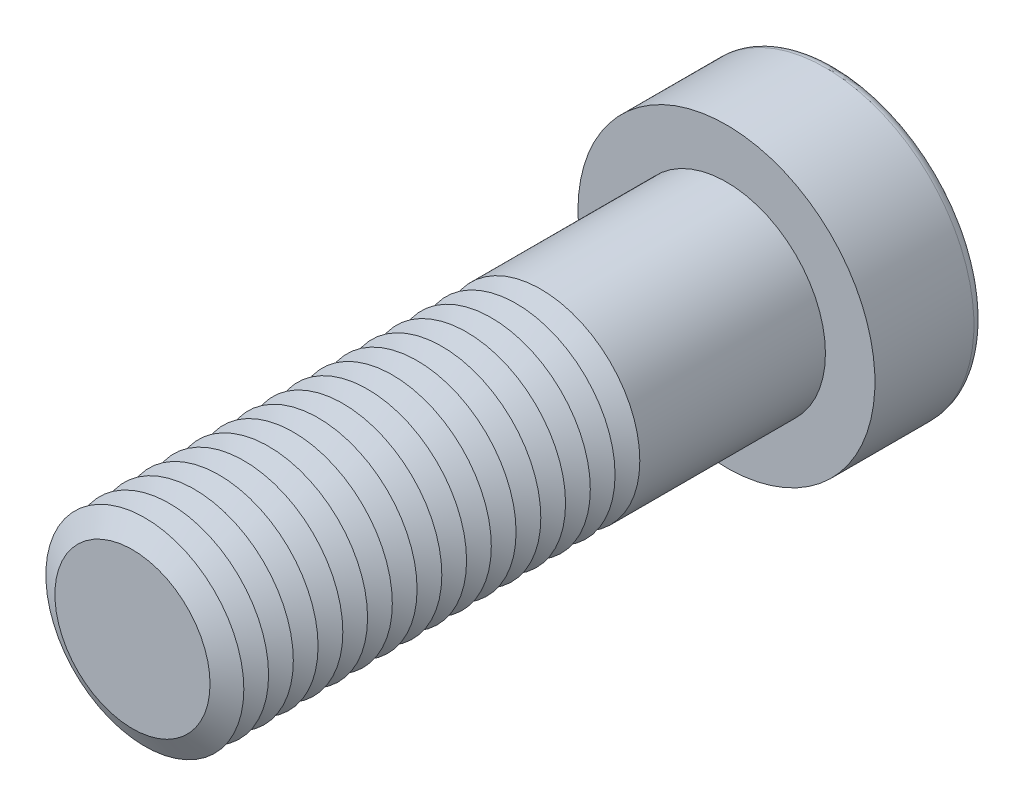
ISO-10303-21;
HEADER;
FILE_DESCRIPTION(('STEP AP214'),'2;1');
FILE_NAME('part.step','',(''),(''),'','','');
FILE_SCHEMA(('AUTOMOTIVE_DESIGN { 1 0 10303 214 1 1 1 1 }'));
ENDSEC;
DATA;
#1=APPLICATION_CONTEXT('core data for automotive mechanical design processes');
#2=APPLICATION_PROTOCOL_DEFINITION('international standard','automotive_design',2000,#1);
#3=PRODUCT_CONTEXT('',#1,'mechanical');
#4=PRODUCT('Part','Part','',(#3));
#5=PRODUCT_RELATED_PRODUCT_CATEGORY('part','',(#4));
#6=PRODUCT_DEFINITION_FORMATION('','',#4);
#7=PRODUCT_DEFINITION_CONTEXT('part definition',#1,'design');
#8=PRODUCT_DEFINITION('design','',#6,#7);
#9=PRODUCT_DEFINITION_SHAPE('','',#8);
#10=(LENGTH_UNIT() NAMED_UNIT(*) SI_UNIT(.MILLI.,.METRE.));
#11=(NAMED_UNIT(*) PLANE_ANGLE_UNIT() SI_UNIT($,.RADIAN.));
#12=(NAMED_UNIT(*) SI_UNIT($,.STERADIAN.) SOLID_ANGLE_UNIT());
#13=UNCERTAINTY_MEASURE_WITH_UNIT(LENGTH_MEASURE(1.E-05),#10,'distance_accuracy_value','');
#14=(GEOMETRIC_REPRESENTATION_CONTEXT(3) GLOBAL_UNCERTAINTY_ASSIGNED_CONTEXT((#13)) GLOBAL_UNIT_ASSIGNED_CONTEXT((#10,
#11,#12)) REPRESENTATION_CONTEXT('',''));
#15=CARTESIAN_POINT('',(0.,0.,0.));
#16=DIRECTION('',(0.,0.,1.));
#17=DIRECTION('',(1.,0.,0.));
#18=AXIS2_PLACEMENT_3D('',#15,#16,#17);
#19=CARTESIAN_POINT('',(0.,0.,51.25));
#20=DIRECTION('',(0.,0.,1.));
#21=DIRECTION('',(1.,0.,0.));
#22=AXIS2_PLACEMENT_3D('',#19,#20,#21);
#23=CONICAL_SURFACE('',#22,10.,1.0471975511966);
#24=CARTESIAN_POINT('',(0.,0.,50.));
#25=DIRECTION('',(0.,0.,1.));
#26=DIRECTION('',(1.,0.,0.));
#27=AXIS2_PLACEMENT_3D('',#24,#25,#26);
#28=CIRCLE('',#27,7.8349364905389);
#29=CARTESIAN_POINT('',(7.8349364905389,0.,50.));
#30=VERTEX_POINT('',#29);
#31=EDGE_CURVE('E312',#30,#30,#28,.T.);
#32=ORIENTED_EDGE('',*,*,#31,.T.);
#33=EDGE_LOOP('',(#32));
#34=FACE_BOUND('',#33,.T.);
#35=CARTESIAN_POINT('',(0.,0.,51.25));
#36=DIRECTION('',(0.,0.,1.));
#37=DIRECTION('',(1.,0.,0.));
#38=AXIS2_PLACEMENT_3D('',#35,#36,#37);
#39=CIRCLE('',#38,10.);
#40=CARTESIAN_POINT('',(10.,0.,51.25));
#41=VERTEX_POINT('',#40);
#42=EDGE_CURVE('E315',#41,#41,#39,.T.);
#43=ORIENTED_EDGE('',*,*,#42,.F.);
#44=EDGE_LOOP('',(#43));
#45=FACE_BOUND('',#44,.T.);
#46=ADVANCED_FACE('F39',(#34,#45),#23,.T.);
#47=CARTESIAN_POINT('',(0.,0.,50.));
#48=DIRECTION('',(0.,0.,-1.));
#49=DIRECTION('',(-1.,0.,0.));
#50=AXIS2_PLACEMENT_3D('',#47,#48,#49);
#51=CONICAL_SURFACE('',#50,7.8349364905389,1.0471975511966);
#52=CARTESIAN_POINT('',(0.,0.,48.75));
#53=DIRECTION('',(0.,0.,1.));
#54=DIRECTION('',(1.,0.,0.));
#55=AXIS2_PLACEMENT_3D('',#52,#53,#54);
#56=CIRCLE('',#55,10.);
#57=CARTESIAN_POINT('',(10.,0.,48.75));
#58=VERTEX_POINT('',#57);
#59=EDGE_CURVE('E323',#58,#58,#56,.T.);
#60=ORIENTED_EDGE('',*,*,#59,.T.);
#61=EDGE_LOOP('',(#60));
#62=FACE_BOUND('',#61,.T.);
#63=ORIENTED_EDGE('',*,*,#31,.F.);
#64=EDGE_LOOP('',(#63));
#65=FACE_BOUND('',#64,.T.);
#66=ADVANCED_FACE('F244',(#62,#65),#51,.T.);
#67=CARTESIAN_POINT('',(0.,0.,60.));
#68=DIRECTION('',(0.,0.,1.));
#69=DIRECTION('',(1.,0.,0.));
#70=AXIS2_PLACEMENT_3D('',#67,#68,#69);
#71=PLANE('',#70);
#72=CARTESIAN_POINT('',(0.,0.,60.));
#73=DIRECTION('',(0.,0.,1.));
#74=DIRECTION('',(1.,0.,0.));
#75=AXIS2_PLACEMENT_3D('',#72,#73,#74);
#76=CIRCLE('',#75,7.8349364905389);
#77=CARTESIAN_POINT('',(7.8349364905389,0.,60.));
#78=VERTEX_POINT('',#77);
#79=EDGE_CURVE('E173',#78,#78,#76,.T.);
#80=ORIENTED_EDGE('',*,*,#79,.T.);
#81=EDGE_LOOP('',(#80));
#82=FACE_BOUND('',#81,.T.);
#83=ADVANCED_FACE('F250',(#82),#71,.T.);
#84=CARTESIAN_POINT('',(0.,0.,60.));
#85=DIRECTION('',(0.,0.,-1.));
#86=DIRECTION('',(-1.,0.,0.));
#87=AXIS2_PLACEMENT_3D('',#84,#85,#86);
#88=CONICAL_SURFACE('',#87,7.8349364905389,1.0471975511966);
#89=CARTESIAN_POINT('',(0.,0.,58.75));
#90=DIRECTION('',(0.,0.,1.));
#91=DIRECTION('',(1.,0.,0.));
#92=AXIS2_PLACEMENT_3D('',#89,#90,#91);
#93=CIRCLE('',#92,10.);
#94=CARTESIAN_POINT('',(10.,0.,58.75));
#95=VERTEX_POINT('',#94);
#96=EDGE_CURVE('E290',#95,#95,#93,.T.);
#97=ORIENTED_EDGE('',*,*,#96,.T.);
#98=EDGE_LOOP('',(#97));
#99=FACE_BOUND('',#98,.T.);
#100=ORIENTED_EDGE('',*,*,#79,.F.);
#101=EDGE_LOOP('',(#100));
#102=FACE_BOUND('',#101,.T.);
#103=ADVANCED_FACE('F198',(#99,#102),#88,.T.);
#104=CARTESIAN_POINT('',(0.,0.,58.75));
#105=DIRECTION('',(0.,0.,1.));
#106=DIRECTION('',(1.,0.,0.));
#107=AXIS2_PLACEMENT_3D('',#104,#105,#106);
#108=CONICAL_SURFACE('',#107,10.,1.0471975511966);
#109=CARTESIAN_POINT('',(0.,0.,57.5));
#110=DIRECTION('',(0.,0.,1.));
#111=DIRECTION('',(1.,0.,0.));
#112=AXIS2_PLACEMENT_3D('',#109,#110,#111);
#113=CIRCLE('',#112,7.8349364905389);
#114=CARTESIAN_POINT('',(7.8349364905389,0.,57.5));
#115=VERTEX_POINT('',#114);
#116=EDGE_CURVE('E287',#115,#115,#113,.T.);
#117=ORIENTED_EDGE('',*,*,#116,.T.);
#118=EDGE_LOOP('',(#117));
#119=FACE_BOUND('',#118,.T.);
#120=ORIENTED_EDGE('',*,*,#96,.F.);
#121=EDGE_LOOP('',(#120));
#122=FACE_BOUND('',#121,.T.);
#123=ADVANCED_FACE('F276',(#119,#122),#108,.T.);
#124=CARTESIAN_POINT('',(0.,0.,57.5));
#125=DIRECTION('',(0.,0.,-1.));
#126=DIRECTION('',(-1.,0.,0.));
#127=AXIS2_PLACEMENT_3D('',#124,#125,#126);
#128=CONICAL_SURFACE('',#127,7.8349364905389,1.0471975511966);
#129=CARTESIAN_POINT('',(0.,0.,56.25));
#130=DIRECTION('',(0.,0.,1.));
#131=DIRECTION('',(1.,0.,0.));
#132=AXIS2_PLACEMENT_3D('',#129,#130,#131);
#133=CIRCLE('',#132,10.);
#134=CARTESIAN_POINT('',(10.,0.,56.25));
#135=VERTEX_POINT('',#134);
#136=EDGE_CURVE('E299',#135,#135,#133,.T.);
#137=ORIENTED_EDGE('',*,*,#136,.T.);
#138=EDGE_LOOP('',(#137));
#139=FACE_BOUND('',#138,.T.);
#140=ORIENTED_EDGE('',*,*,#116,.F.);
#141=EDGE_LOOP('',(#140));
#142=FACE_BOUND('',#141,.T.);
#143=ADVANCED_FACE('F273',(#139,#142),#128,.T.);
#144=CARTESIAN_POINT('',(0.,0.,56.25));
#145=DIRECTION('',(0.,0.,1.));
#146=DIRECTION('',(1.,0.,0.));
#147=AXIS2_PLACEMENT_3D('',#144,#145,#146);
#148=CONICAL_SURFACE('',#147,10.,1.0471975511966);
#149=CARTESIAN_POINT('',(0.,0.,55.));
#150=DIRECTION('',(0.,0.,1.));
#151=DIRECTION('',(1.,0.,0.));
#152=AXIS2_PLACEMENT_3D('',#149,#150,#151);
#153=CIRCLE('',#152,7.8349364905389);
#154=CARTESIAN_POINT('',(7.8349364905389,0.,55.));
#155=VERTEX_POINT('',#154);
#156=EDGE_CURVE('E292',#155,#155,#153,.T.);
#157=ORIENTED_EDGE('',*,*,#156,.T.);
#158=EDGE_LOOP('',(#157));
#159=FACE_BOUND('',#158,.T.);
#160=ORIENTED_EDGE('',*,*,#136,.F.);
#161=EDGE_LOOP('',(#160));
#162=FACE_BOUND('',#161,.T.);
#163=ADVANCED_FACE('F269',(#159,#162),#148,.T.);
#164=CARTESIAN_POINT('',(0.,0.,55.));
#165=DIRECTION('',(0.,0.,-1.));
#166=DIRECTION('',(-1.,0.,0.));
#167=AXIS2_PLACEMENT_3D('',#164,#165,#166);
#168=CONICAL_SURFACE('',#167,7.8349364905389,1.0471975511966);
#169=CARTESIAN_POINT('',(0.,0.,53.75));
#170=DIRECTION('',(0.,0.,1.));
#171=DIRECTION('',(1.,0.,0.));
#172=AXIS2_PLACEMENT_3D('',#169,#170,#171);
#173=CIRCLE('',#172,10.);
#174=CARTESIAN_POINT('',(10.,0.,53.75));
#175=VERTEX_POINT('',#174);
#176=EDGE_CURVE('E309',#175,#175,#173,.T.);
#177=ORIENTED_EDGE('',*,*,#176,.T.);
#178=EDGE_LOOP('',(#177));
#179=FACE_BOUND('',#178,.T.);
#180=ORIENTED_EDGE('',*,*,#156,.F.);
#181=EDGE_LOOP('',(#180));
#182=FACE_BOUND('',#181,.T.);
#183=ADVANCED_FACE('F265',(#179,#182),#168,.T.);
#184=CARTESIAN_POINT('',(0.,0.,53.75));
#185=DIRECTION('',(0.,0.,1.));
#186=DIRECTION('',(1.,0.,0.));
#187=AXIS2_PLACEMENT_3D('',#184,#185,#186);
#188=CONICAL_SURFACE('',#187,10.,1.0471975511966);
#189=CARTESIAN_POINT('',(0.,0.,52.5));
#190=DIRECTION('',(0.,0.,1.));
#191=DIRECTION('',(1.,0.,0.));
#192=AXIS2_PLACEMENT_3D('',#189,#190,#191);
#193=CIRCLE('',#192,7.8349364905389);
#194=CARTESIAN_POINT('',(7.8349364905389,0.,52.5));
#195=VERTEX_POINT('',#194);
#196=EDGE_CURVE('E305',#195,#195,#193,.T.);
#197=ORIENTED_EDGE('',*,*,#196,.T.);
#198=EDGE_LOOP('',(#197));
#199=FACE_BOUND('',#198,.T.);
#200=ORIENTED_EDGE('',*,*,#176,.F.);
#201=EDGE_LOOP('',(#200));
#202=FACE_BOUND('',#201,.T.);
#203=ADVANCED_FACE('F261',(#199,#202),#188,.T.);
#204=CARTESIAN_POINT('',(0.,0.,52.5));
#205=DIRECTION('',(0.,0.,-1.));
#206=DIRECTION('',(-1.,0.,0.));
#207=AXIS2_PLACEMENT_3D('',#204,#205,#206);
#208=CONICAL_SURFACE('',#207,7.8349364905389,1.0471975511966);
#209=ORIENTED_EDGE('',*,*,#42,.T.);
#210=EDGE_LOOP('',(#209));
#211=FACE_BOUND('',#210,.T.);
#212=ORIENTED_EDGE('',*,*,#196,.F.);
#213=EDGE_LOOP('',(#212));
#214=FACE_BOUND('',#213,.T.);
#215=ADVANCED_FACE('F257',(#211,#214),#208,.T.);
#216=CARTESIAN_POINT('',(0.,0.,48.75));
#217=DIRECTION('',(0.,0.,1.));
#218=DIRECTION('',(1.,0.,0.));
#219=AXIS2_PLACEMENT_3D('',#216,#217,#218);
#220=CONICAL_SURFACE('',#219,10.,1.0471975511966);
#221=CARTESIAN_POINT('',(0.,0.,47.5));
#222=DIRECTION('',(0.,0.,1.));
#223=DIRECTION('',(1.,0.,0.));
#224=AXIS2_PLACEMENT_3D('',#221,#222,#223);
#225=CIRCLE('',#224,7.8349364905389);
#226=CARTESIAN_POINT('',(7.8349364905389,0.,47.5));
#227=VERTEX_POINT('',#226);
#228=EDGE_CURVE('E319',#227,#227,#225,.T.);
#229=ORIENTED_EDGE('',*,*,#228,.T.);
#230=EDGE_LOOP('',(#229));
#231=FACE_BOUND('',#230,.T.);
#232=ORIENTED_EDGE('',*,*,#59,.F.);
#233=EDGE_LOOP('',(#232));
#234=FACE_BOUND('',#233,.T.);
#235=ADVANCED_FACE('F260',(#231,#234),#220,.T.);
#236=CARTESIAN_POINT('',(0.,0.,47.5));
#237=DIRECTION('',(0.,0.,-1.));
#238=DIRECTION('',(-1.,0.,0.));
#239=AXIS2_PLACEMENT_3D('',#236,#237,#238);
#240=CONICAL_SURFACE('',#239,7.8349364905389,1.0471975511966);
#241=CARTESIAN_POINT('',(0.,0.,46.25));
#242=DIRECTION('',(0.,0.,1.));
#243=DIRECTION('',(1.,0.,0.));
#244=AXIS2_PLACEMENT_3D('',#241,#242,#243);
#245=CIRCLE('',#244,10.);
#246=CARTESIAN_POINT('',(10.,0.,46.25));
#247=VERTEX_POINT('',#246);
#248=EDGE_CURVE('E331',#247,#247,#245,.T.);
#249=ORIENTED_EDGE('',*,*,#248,.T.);
#250=EDGE_LOOP('',(#249));
#251=FACE_BOUND('',#250,.T.);
#252=ORIENTED_EDGE('',*,*,#228,.F.);
#253=EDGE_LOOP('',(#252));
#254=FACE_BOUND('',#253,.T.);
#255=ADVANCED_FACE('F511',(#251,#254),#240,.T.);
#256=CARTESIAN_POINT('',(0.,0.,46.25));
#257=DIRECTION('',(0.,0.,1.));
#258=DIRECTION('',(1.,0.,0.));
#259=AXIS2_PLACEMENT_3D('',#256,#257,#258);
#260=CONICAL_SURFACE('',#259,10.,1.0471975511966);
#261=CARTESIAN_POINT('',(0.,0.,45.));
#262=DIRECTION('',(0.,0.,1.));
#263=DIRECTION('',(1.,0.,0.));
#264=AXIS2_PLACEMENT_3D('',#261,#262,#263);
#265=CIRCLE('',#264,7.8349364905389);
#266=CARTESIAN_POINT('',(7.8349364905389,0.,45.));
#267=VERTEX_POINT('',#266);
#268=EDGE_CURVE('E327',#267,#267,#265,.T.);
#269=ORIENTED_EDGE('',*,*,#268,.T.);
#270=EDGE_LOOP('',(#269));
#271=FACE_BOUND('',#270,.T.);
#272=ORIENTED_EDGE('',*,*,#248,.F.);
#273=EDGE_LOOP('',(#272));
#274=FACE_BOUND('',#273,.T.);
#275=ADVANCED_FACE('F507',(#271,#274),#260,.T.);
#276=CARTESIAN_POINT('',(0.,0.,45.));
#277=DIRECTION('',(0.,0.,-1.));
#278=DIRECTION('',(-1.,0.,0.));
#279=AXIS2_PLACEMENT_3D('',#276,#277,#278);
#280=CONICAL_SURFACE('',#279,7.8349364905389,1.0471975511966);
#281=CARTESIAN_POINT('',(0.,0.,43.75));
#282=DIRECTION('',(0.,0.,1.));
#283=DIRECTION('',(1.,0.,0.));
#284=AXIS2_PLACEMENT_3D('',#281,#282,#283);
#285=CIRCLE('',#284,10.);
#286=CARTESIAN_POINT('',(10.,0.,43.75));
#287=VERTEX_POINT('',#286);
#288=EDGE_CURVE('E339',#287,#287,#285,.T.);
#289=ORIENTED_EDGE('',*,*,#288,.T.);
#290=EDGE_LOOP('',(#289));
#291=FACE_BOUND('',#290,.T.);
#292=ORIENTED_EDGE('',*,*,#268,.F.);
#293=EDGE_LOOP('',(#292));
#294=FACE_BOUND('',#293,.T.);
#295=ADVANCED_FACE('F503',(#291,#294),#280,.T.);
#296=CARTESIAN_POINT('',(0.,0.,43.75));
#297=DIRECTION('',(0.,0.,1.));
#298=DIRECTION('',(1.,0.,0.));
#299=AXIS2_PLACEMENT_3D('',#296,#297,#298);
#300=CONICAL_SURFACE('',#299,10.,1.0471975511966);
#301=CARTESIAN_POINT('',(0.,0.,42.5));
#302=DIRECTION('',(0.,0.,1.));
#303=DIRECTION('',(1.,0.,0.));
#304=AXIS2_PLACEMENT_3D('',#301,#302,#303);
#305=CIRCLE('',#304,7.8349364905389);
#306=CARTESIAN_POINT('',(7.8349364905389,0.,42.5));
#307=VERTEX_POINT('',#306);
#308=EDGE_CURVE('E335',#307,#307,#305,.T.);
#309=ORIENTED_EDGE('',*,*,#308,.T.);
#310=EDGE_LOOP('',(#309));
#311=FACE_BOUND('',#310,.T.);
#312=ORIENTED_EDGE('',*,*,#288,.F.);
#313=EDGE_LOOP('',(#312));
#314=FACE_BOUND('',#313,.T.);
#315=ADVANCED_FACE('F499',(#311,#314),#300,.T.);
#316=CARTESIAN_POINT('',(0.,0.,42.5));
#317=DIRECTION('',(0.,0.,-1.));
#318=DIRECTION('',(-1.,0.,0.));
#319=AXIS2_PLACEMENT_3D('',#316,#317,#318);
#320=CONICAL_SURFACE('',#319,7.8349364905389,1.0471975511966);
#321=CARTESIAN_POINT('',(0.,0.,41.25));
#322=DIRECTION('',(0.,0.,1.));
#323=DIRECTION('',(1.,0.,0.));
#324=AXIS2_PLACEMENT_3D('',#321,#322,#323);
#325=CIRCLE('',#324,10.);
#326=CARTESIAN_POINT('',(10.,0.,41.25));
#327=VERTEX_POINT('',#326);
#328=EDGE_CURVE('E346',#327,#327,#325,.T.);
#329=ORIENTED_EDGE('',*,*,#328,.T.);
#330=EDGE_LOOP('',(#329));
#331=FACE_BOUND('',#330,.T.);
#332=ORIENTED_EDGE('',*,*,#308,.F.);
#333=EDGE_LOOP('',(#332));
#334=FACE_BOUND('',#333,.T.);
#335=ADVANCED_FACE('F495',(#331,#334),#320,.T.);
#336=CARTESIAN_POINT('',(0.,0.,41.25));
#337=DIRECTION('',(0.,0.,1.));
#338=DIRECTION('',(1.,0.,0.));
#339=AXIS2_PLACEMENT_3D('',#336,#337,#338);
#340=CONICAL_SURFACE('',#339,10.,1.0471975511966);
#341=CARTESIAN_POINT('',(0.,0.,40.));
#342=DIRECTION('',(0.,0.,1.));
#343=DIRECTION('',(1.,0.,0.));
#344=AXIS2_PLACEMENT_3D('',#341,#342,#343);
#345=CIRCLE('',#344,7.8349364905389);
#346=CARTESIAN_POINT('',(7.8349364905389,0.,40.));
#347=VERTEX_POINT('',#346);
#348=EDGE_CURVE('E342',#347,#347,#345,.T.);
#349=ORIENTED_EDGE('',*,*,#348,.T.);
#350=EDGE_LOOP('',(#349));
#351=FACE_BOUND('',#350,.T.);
#352=ORIENTED_EDGE('',*,*,#328,.F.);
#353=EDGE_LOOP('',(#352));
#354=FACE_BOUND('',#353,.T.);
#355=ADVANCED_FACE('F491',(#351,#354),#340,.T.);
#356=CARTESIAN_POINT('',(0.,0.,40.));
#357=DIRECTION('',(0.,0.,-1.));
#358=DIRECTION('',(-1.,0.,0.));
#359=AXIS2_PLACEMENT_3D('',#356,#357,#358);
#360=CONICAL_SURFACE('',#359,7.8349364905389,1.0471975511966);
#361=CARTESIAN_POINT('',(0.,0.,38.75));
#362=DIRECTION('',(0.,0.,1.));
#363=DIRECTION('',(1.,0.,0.));
#364=AXIS2_PLACEMENT_3D('',#361,#362,#363);
#365=CIRCLE('',#364,10.);
#366=CARTESIAN_POINT('',(10.,0.,38.75));
#367=VERTEX_POINT('',#366);
#368=EDGE_CURVE('E354',#367,#367,#365,.T.);
#369=ORIENTED_EDGE('',*,*,#368,.T.);
#370=EDGE_LOOP('',(#369));
#371=FACE_BOUND('',#370,.T.);
#372=ORIENTED_EDGE('',*,*,#348,.F.);
#373=EDGE_LOOP('',(#372));
#374=FACE_BOUND('',#373,.T.);
#375=ADVANCED_FACE('F487',(#371,#374),#360,.T.);
#376=CARTESIAN_POINT('',(0.,0.,38.75));
#377=DIRECTION('',(0.,0.,1.));
#378=DIRECTION('',(1.,0.,0.));
#379=AXIS2_PLACEMENT_3D('',#376,#377,#378);
#380=CONICAL_SURFACE('',#379,10.,1.0471975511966);
#381=CARTESIAN_POINT('',(0.,0.,37.5));
#382=DIRECTION('',(0.,0.,1.));
#383=DIRECTION('',(1.,0.,0.));
#384=AXIS2_PLACEMENT_3D('',#381,#382,#383);
#385=CIRCLE('',#384,7.8349364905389);
#386=CARTESIAN_POINT('',(7.8349364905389,0.,37.5));
#387=VERTEX_POINT('',#386);
#388=EDGE_CURVE('E350',#387,#387,#385,.T.);
#389=ORIENTED_EDGE('',*,*,#388,.T.);
#390=EDGE_LOOP('',(#389));
#391=FACE_BOUND('',#390,.T.);
#392=ORIENTED_EDGE('',*,*,#368,.F.);
#393=EDGE_LOOP('',(#392));
#394=FACE_BOUND('',#393,.T.);
#395=ADVANCED_FACE('F483',(#391,#394),#380,.T.);
#396=CARTESIAN_POINT('',(0.,0.,37.5));
#397=DIRECTION('',(0.,0.,-1.));
#398=DIRECTION('',(-1.,0.,0.));
#399=AXIS2_PLACEMENT_3D('',#396,#397,#398);
#400=CONICAL_SURFACE('',#399,7.8349364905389,1.0471975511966);
#401=CARTESIAN_POINT('',(0.,0.,36.25));
#402=DIRECTION('',(0.,0.,1.));
#403=DIRECTION('',(1.,0.,0.));
#404=AXIS2_PLACEMENT_3D('',#401,#402,#403);
#405=CIRCLE('',#404,10.);
#406=CARTESIAN_POINT('',(10.,0.,36.25));
#407=VERTEX_POINT('',#406);
#408=EDGE_CURVE('E362',#407,#407,#405,.T.);
#409=ORIENTED_EDGE('',*,*,#408,.T.);
#410=EDGE_LOOP('',(#409));
#411=FACE_BOUND('',#410,.T.);
#412=ORIENTED_EDGE('',*,*,#388,.F.);
#413=EDGE_LOOP('',(#412));
#414=FACE_BOUND('',#413,.T.);
#415=ADVANCED_FACE('F479',(#411,#414),#400,.T.);
#416=CARTESIAN_POINT('',(0.,0.,36.25));
#417=DIRECTION('',(0.,0.,1.));
#418=DIRECTION('',(1.,0.,0.));
#419=AXIS2_PLACEMENT_3D('',#416,#417,#418);
#420=CONICAL_SURFACE('',#419,10.,1.0471975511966);
#421=CARTESIAN_POINT('',(0.,0.,35.));
#422=DIRECTION('',(0.,0.,1.));
#423=DIRECTION('',(1.,0.,0.));
#424=AXIS2_PLACEMENT_3D('',#421,#422,#423);
#425=CIRCLE('',#424,7.8349364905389);
#426=CARTESIAN_POINT('',(7.8349364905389,0.,35.));
#427=VERTEX_POINT('',#426);
#428=EDGE_CURVE('E358',#427,#427,#425,.T.);
#429=ORIENTED_EDGE('',*,*,#428,.T.);
#430=EDGE_LOOP('',(#429));
#431=FACE_BOUND('',#430,.T.);
#432=ORIENTED_EDGE('',*,*,#408,.F.);
#433=EDGE_LOOP('',(#432));
#434=FACE_BOUND('',#433,.T.);
#435=ADVANCED_FACE('F475',(#431,#434),#420,.T.);
#436=CARTESIAN_POINT('',(0.,0.,35.));
#437=DIRECTION('',(0.,0.,-1.));
#438=DIRECTION('',(-1.,0.,0.));
#439=AXIS2_PLACEMENT_3D('',#436,#437,#438);
#440=CONICAL_SURFACE('',#439,7.8349364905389,1.0471975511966);
#441=CARTESIAN_POINT('',(0.,0.,33.75));
#442=DIRECTION('',(0.,0.,1.));
#443=DIRECTION('',(1.,0.,0.));
#444=AXIS2_PLACEMENT_3D('',#441,#442,#443);
#445=CIRCLE('',#444,10.);
#446=CARTESIAN_POINT('',(10.,0.,33.75));
#447=VERTEX_POINT('',#446);
#448=EDGE_CURVE('E370',#447,#447,#445,.T.);
#449=ORIENTED_EDGE('',*,*,#448,.T.);
#450=EDGE_LOOP('',(#449));
#451=FACE_BOUND('',#450,.T.);
#452=ORIENTED_EDGE('',*,*,#428,.F.);
#453=EDGE_LOOP('',(#452));
#454=FACE_BOUND('',#453,.T.);
#455=ADVANCED_FACE('F471',(#451,#454),#440,.T.);
#456=CARTESIAN_POINT('',(0.,0.,33.75));
#457=DIRECTION('',(0.,0.,1.));
#458=DIRECTION('',(1.,0.,0.));
#459=AXIS2_PLACEMENT_3D('',#456,#457,#458);
#460=CONICAL_SURFACE('',#459,10.,1.0471975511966);
#461=CARTESIAN_POINT('',(0.,0.,32.5));
#462=DIRECTION('',(0.,0.,1.));
#463=DIRECTION('',(1.,0.,0.));
#464=AXIS2_PLACEMENT_3D('',#461,#462,#463);
#465=CIRCLE('',#464,7.8349364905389);
#466=CARTESIAN_POINT('',(7.8349364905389,0.,32.5));
#467=VERTEX_POINT('',#466);
#468=EDGE_CURVE('E366',#467,#467,#465,.T.);
#469=ORIENTED_EDGE('',*,*,#468,.T.);
#470=EDGE_LOOP('',(#469));
#471=FACE_BOUND('',#470,.T.);
#472=ORIENTED_EDGE('',*,*,#448,.F.);
#473=EDGE_LOOP('',(#472));
#474=FACE_BOUND('',#473,.T.);
#475=ADVANCED_FACE('F467',(#471,#474),#460,.T.);
#476=CARTESIAN_POINT('',(0.,0.,32.5));
#477=DIRECTION('',(0.,0.,-1.));
#478=DIRECTION('',(-1.,0.,0.));
#479=AXIS2_PLACEMENT_3D('',#476,#477,#478);
#480=CONICAL_SURFACE('',#479,7.8349364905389,1.0471975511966);
#481=CARTESIAN_POINT('',(0.,0.,31.25));
#482=DIRECTION('',(0.,0.,1.));
#483=DIRECTION('',(1.,0.,0.));
#484=AXIS2_PLACEMENT_3D('',#481,#482,#483);
#485=CIRCLE('',#484,10.);
#486=CARTESIAN_POINT('',(10.,0.,31.25));
#487=VERTEX_POINT('',#486);
#488=EDGE_CURVE('E378',#487,#487,#485,.T.);
#489=ORIENTED_EDGE('',*,*,#488,.T.);
#490=EDGE_LOOP('',(#489));
#491=FACE_BOUND('',#490,.T.);
#492=ORIENTED_EDGE('',*,*,#468,.F.);
#493=EDGE_LOOP('',(#492));
#494=FACE_BOUND('',#493,.T.);
#495=ADVANCED_FACE('F463',(#491,#494),#480,.T.);
#496=CARTESIAN_POINT('',(0.,0.,31.25));
#497=DIRECTION('',(0.,0.,1.));
#498=DIRECTION('',(1.,0.,0.));
#499=AXIS2_PLACEMENT_3D('',#496,#497,#498);
#500=CONICAL_SURFACE('',#499,10.,1.0471975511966);
#501=CARTESIAN_POINT('',(0.,0.,30.));
#502=DIRECTION('',(0.,0.,1.));
#503=DIRECTION('',(1.,0.,0.));
#504=AXIS2_PLACEMENT_3D('',#501,#502,#503);
#505=CIRCLE('',#504,7.8349364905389);
#506=CARTESIAN_POINT('',(7.8349364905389,0.,30.));
#507=VERTEX_POINT('',#506);
#508=EDGE_CURVE('E374',#507,#507,#505,.T.);
#509=ORIENTED_EDGE('',*,*,#508,.T.);
#510=EDGE_LOOP('',(#509));
#511=FACE_BOUND('',#510,.T.);
#512=ORIENTED_EDGE('',*,*,#488,.F.);
#513=EDGE_LOOP('',(#512));
#514=FACE_BOUND('',#513,.T.);
#515=ADVANCED_FACE('F459',(#511,#514),#500,.T.);
#516=CARTESIAN_POINT('',(0.,0.,30.));
#517=DIRECTION('',(0.,0.,-1.));
#518=DIRECTION('',(-1.,0.,0.));
#519=AXIS2_PLACEMENT_3D('',#516,#517,#518);
#520=CONICAL_SURFACE('',#519,7.8349364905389,1.0471975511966);
#521=CARTESIAN_POINT('',(0.,0.,28.75));
#522=DIRECTION('',(0.,0.,1.));
#523=DIRECTION('',(1.,0.,0.));
#524=AXIS2_PLACEMENT_3D('',#521,#522,#523);
#525=CIRCLE('',#524,10.);
#526=CARTESIAN_POINT('',(10.,0.,28.75));
#527=VERTEX_POINT('',#526);
#528=EDGE_CURVE('E386',#527,#527,#525,.T.);
#529=ORIENTED_EDGE('',*,*,#528,.T.);
#530=EDGE_LOOP('',(#529));
#531=FACE_BOUND('',#530,.T.);
#532=ORIENTED_EDGE('',*,*,#508,.F.);
#533=EDGE_LOOP('',(#532));
#534=FACE_BOUND('',#533,.T.);
#535=ADVANCED_FACE('F455',(#531,#534),#520,.T.);
#536=CARTESIAN_POINT('',(0.,0.,28.75));
#537=DIRECTION('',(0.,0.,1.));
#538=DIRECTION('',(1.,0.,0.));
#539=AXIS2_PLACEMENT_3D('',#536,#537,#538);
#540=CONICAL_SURFACE('',#539,10.,1.0471975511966);
#541=CARTESIAN_POINT('',(0.,0.,27.5));
#542=DIRECTION('',(0.,0.,1.));
#543=DIRECTION('',(1.,0.,0.));
#544=AXIS2_PLACEMENT_3D('',#541,#542,#543);
#545=CIRCLE('',#544,7.8349364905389);
#546=CARTESIAN_POINT('',(7.8349364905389,0.,27.5));
#547=VERTEX_POINT('',#546);
#548=EDGE_CURVE('E382',#547,#547,#545,.T.);
#549=ORIENTED_EDGE('',*,*,#548,.T.);
#550=EDGE_LOOP('',(#549));
#551=FACE_BOUND('',#550,.T.);
#552=ORIENTED_EDGE('',*,*,#528,.F.);
#553=EDGE_LOOP('',(#552));
#554=FACE_BOUND('',#553,.T.);
#555=ADVANCED_FACE('F451',(#551,#554),#540,.T.);
#556=CARTESIAN_POINT('',(0.,0.,27.5));
#557=DIRECTION('',(0.,0.,-1.));
#558=DIRECTION('',(-1.,0.,0.));
#559=AXIS2_PLACEMENT_3D('',#556,#557,#558);
#560=CONICAL_SURFACE('',#559,7.8349364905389,1.0471975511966);
#561=CARTESIAN_POINT('',(0.,0.,26.25));
#562=DIRECTION('',(0.,0.,1.));
#563=DIRECTION('',(1.,0.,0.));
#564=AXIS2_PLACEMENT_3D('',#561,#562,#563);
#565=CIRCLE('',#564,10.);
#566=CARTESIAN_POINT('',(10.,0.,26.25));
#567=VERTEX_POINT('',#566);
#568=EDGE_CURVE('E394',#567,#567,#565,.T.);
#569=ORIENTED_EDGE('',*,*,#568,.T.);
#570=EDGE_LOOP('',(#569));
#571=FACE_BOUND('',#570,.T.);
#572=ORIENTED_EDGE('',*,*,#548,.F.);
#573=EDGE_LOOP('',(#572));
#574=FACE_BOUND('',#573,.T.);
#575=ADVANCED_FACE('F447',(#571,#574),#560,.T.);
#576=CARTESIAN_POINT('',(0.,0.,26.25));
#577=DIRECTION('',(0.,0.,1.));
#578=DIRECTION('',(1.,0.,0.));
#579=AXIS2_PLACEMENT_3D('',#576,#577,#578);
#580=CONICAL_SURFACE('',#579,10.,1.0471975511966);
#581=CARTESIAN_POINT('',(0.,0.,25.));
#582=DIRECTION('',(0.,0.,1.));
#583=DIRECTION('',(1.,0.,0.));
#584=AXIS2_PLACEMENT_3D('',#581,#582,#583);
#585=CIRCLE('',#584,7.8349364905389);
#586=CARTESIAN_POINT('',(7.8349364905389,0.,25.));
#587=VERTEX_POINT('',#586);
#588=EDGE_CURVE('E390',#587,#587,#585,.T.);
#589=ORIENTED_EDGE('',*,*,#588,.T.);
#590=EDGE_LOOP('',(#589));
#591=FACE_BOUND('',#590,.T.);
#592=ORIENTED_EDGE('',*,*,#568,.F.);
#593=EDGE_LOOP('',(#592));
#594=FACE_BOUND('',#593,.T.);
#595=ADVANCED_FACE('F443',(#591,#594),#580,.T.);
#596=CARTESIAN_POINT('',(0.,0.,25.));
#597=DIRECTION('',(0.,0.,-1.));
#598=DIRECTION('',(-1.,0.,0.));
#599=AXIS2_PLACEMENT_3D('',#596,#597,#598);
#600=CONICAL_SURFACE('',#599,7.8349364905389,1.0471975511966);
#601=CARTESIAN_POINT('',(0.,0.,23.75));
#602=DIRECTION('',(0.,0.,1.));
#603=DIRECTION('',(1.,0.,0.));
#604=AXIS2_PLACEMENT_3D('',#601,#602,#603);
#605=CIRCLE('',#604,10.);
#606=CARTESIAN_POINT('',(10.,0.,23.75));
#607=VERTEX_POINT('',#606);
#608=EDGE_CURVE('E402',#607,#607,#605,.T.);
#609=ORIENTED_EDGE('',*,*,#608,.T.);
#610=EDGE_LOOP('',(#609));
#611=FACE_BOUND('',#610,.T.);
#612=ORIENTED_EDGE('',*,*,#588,.F.);
#613=EDGE_LOOP('',(#612));
#614=FACE_BOUND('',#613,.T.);
#615=ADVANCED_FACE('F439',(#611,#614),#600,.T.);
#616=CARTESIAN_POINT('',(0.,0.,23.75));
#617=DIRECTION('',(0.,0.,1.));
#618=DIRECTION('',(1.,0.,0.));
#619=AXIS2_PLACEMENT_3D('',#616,#617,#618);
#620=CONICAL_SURFACE('',#619,10.,1.0471975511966);
#621=CARTESIAN_POINT('',(0.,0.,22.5));
#622=DIRECTION('',(0.,0.,1.));
#623=DIRECTION('',(1.,0.,0.));
#624=AXIS2_PLACEMENT_3D('',#621,#622,#623);
#625=CIRCLE('',#624,7.8349364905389);
#626=CARTESIAN_POINT('',(7.8349364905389,0.,22.5));
#627=VERTEX_POINT('',#626);
#628=EDGE_CURVE('E398',#627,#627,#625,.T.);
#629=ORIENTED_EDGE('',*,*,#628,.T.);
#630=EDGE_LOOP('',(#629));
#631=FACE_BOUND('',#630,.T.);
#632=ORIENTED_EDGE('',*,*,#608,.F.);
#633=EDGE_LOOP('',(#632));
#634=FACE_BOUND('',#633,.T.);
#635=ADVANCED_FACE('F434',(#631,#634),#620,.T.);
#636=CARTESIAN_POINT('',(0.,0.,22.5));
#637=DIRECTION('',(0.,0.,-1.));
#638=DIRECTION('',(-1.,0.,0.));
#639=AXIS2_PLACEMENT_3D('',#636,#637,#638);
#640=CONICAL_SURFACE('',#639,7.8349364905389,1.0471975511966);
#641=CARTESIAN_POINT('',(0.,0.,21.25));
#642=DIRECTION('',(0.,0.,1.));
#643=DIRECTION('',(1.,0.,0.));
#644=AXIS2_PLACEMENT_3D('',#641,#642,#643);
#645=CIRCLE('',#644,10.);
#646=CARTESIAN_POINT('',(10.,0.,21.25));
#647=VERTEX_POINT('',#646);
#648=EDGE_CURVE('E414',#647,#647,#645,.T.);
#649=ORIENTED_EDGE('',*,*,#648,.T.);
#650=EDGE_LOOP('',(#649));
#651=FACE_BOUND('',#650,.T.);
#652=ORIENTED_EDGE('',*,*,#628,.F.);
#653=EDGE_LOOP('',(#652));
#654=FACE_BOUND('',#653,.T.);
#655=ADVANCED_FACE('F420',(#651,#654),#640,.T.);
#656=CARTESIAN_POINT('',(0.,0.,21.25));
#657=DIRECTION('',(0.,0.,1.));
#658=DIRECTION('',(1.,0.,0.));
#659=AXIS2_PLACEMENT_3D('',#656,#657,#658);
#660=CONICAL_SURFACE('',#659,10.,1.0471975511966);
#661=CARTESIAN_POINT('',(0.,0.,20.));
#662=DIRECTION('',(0.,0.,1.));
#663=DIRECTION('',(1.,0.,0.));
#664=AXIS2_PLACEMENT_3D('',#661,#662,#663);
#665=CIRCLE('',#664,7.8349364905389);
#666=CARTESIAN_POINT('',(7.8349364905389,0.,20.));
#667=VERTEX_POINT('',#666);
#668=EDGE_CURVE('E406',#667,#667,#665,.T.);
#669=ORIENTED_EDGE('',*,*,#668,.T.);
#670=EDGE_LOOP('',(#669));
#671=FACE_BOUND('',#670,.T.);
#672=ORIENTED_EDGE('',*,*,#648,.F.);
#673=EDGE_LOOP('',(#672));
#674=FACE_BOUND('',#673,.T.);
#675=ADVANCED_FACE('F423',(#671,#674),#660,.T.);
#676=CARTESIAN_POINT('',(0.,0.,20.));
#677=DIRECTION('',(0.,0.,-1.));
#678=DIRECTION('',(-1.,0.,0.));
#679=AXIS2_PLACEMENT_3D('',#676,#677,#678);
#680=CONICAL_SURFACE('',#679,7.8349364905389,1.0471975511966);
#681=CARTESIAN_POINT('',(0.,0.,18.75));
#682=DIRECTION('',(0.,0.,1.));
#683=DIRECTION('',(1.,0.,0.));
#684=AXIS2_PLACEMENT_3D('',#681,#682,#683);
#685=CIRCLE('',#684,10.);
#686=CARTESIAN_POINT('',(10.,0.,18.75));
#687=VERTEX_POINT('',#686);
#688=EDGE_CURVE('E410',#687,#687,#685,.T.);
#689=ORIENTED_EDGE('',*,*,#688,.T.);
#690=EDGE_LOOP('',(#689));
#691=FACE_BOUND('',#690,.T.);
#692=ORIENTED_EDGE('',*,*,#668,.F.);
#693=EDGE_LOOP('',(#692));
#694=FACE_BOUND('',#693,.T.);
#695=ADVANCED_FACE('F425',(#691,#694),#680,.T.);
#696=CARTESIAN_POINT('',(0.,0.,-0.499999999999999));
#697=DIRECTION('',(0.,0.,-1.));
#698=DIRECTION('',(-1.,0.,0.));
#699=AXIS2_PLACEMENT_3D('',#696,#697,#698);
#700=CONICAL_SURFACE('',#699,7.,1.0471975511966);
#701=CARTESIAN_POINT('',(0.,0.,3.54145188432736));
#702=VERTEX_POINT('',#701);
#703=VERTEX_LOOP('',#702);
#704=FACE_BOUND('',#703,.T.);
#705=CARTESIAN_POINT('',(0.,0.,-0.499999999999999));
#706=DIRECTION('',(0.,0.,-1.));
#707=DIRECTION('',(-1.,0.,0.));
#708=AXIS2_PLACEMENT_3D('',#705,#706,#707);
#709=CIRCLE('',#708,7.);
#710=CARTESIAN_POINT('',(-6.06217782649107,3.5,-0.499999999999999));
#711=VERTEX_POINT('',#710);
#712=CARTESIAN_POINT('',(0.,7.,-0.499999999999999));
#713=VERTEX_POINT('',#712);
#714=EDGE_CURVE('E149',#711,#713,#709,.T.);
#715=ORIENTED_EDGE('',*,*,#714,.T.);
#716=CARTESIAN_POINT('',(0.,0.,-0.499999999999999));
#717=DIRECTION('',(0.,0.,-1.));
#718=DIRECTION('',(-1.,0.,0.));
#719=AXIS2_PLACEMENT_3D('',#716,#717,#718);
#720=CIRCLE('',#719,7.);
#721=CARTESIAN_POINT('',(6.06217782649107,3.5,-0.499999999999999));
#722=VERTEX_POINT('',#721);
#723=EDGE_CURVE('E54',#713,#722,#720,.T.);
#724=ORIENTED_EDGE('',*,*,#723,.T.);
#725=CARTESIAN_POINT('',(6.06217782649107,-3.5,-0.499999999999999));
#726=VERTEX_POINT('',#725);
#727=EDGE_CURVE('E1027',#722,#726,#720,.T.);
#728=ORIENTED_EDGE('',*,*,#727,.T.);
#729=CARTESIAN_POINT('',(0.,-7.,-0.499999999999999));
#730=VERTEX_POINT('',#729);
#731=EDGE_CURVE('E1026',#726,#730,#720,.T.);
#732=ORIENTED_EDGE('',*,*,#731,.T.);
#733=CARTESIAN_POINT('',(-6.06217782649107,-3.5,-0.499999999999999));
#734=VERTEX_POINT('',#733);
#735=EDGE_CURVE('E1019',#730,#734,#720,.T.);
#736=ORIENTED_EDGE('',*,*,#735,.T.);
#737=EDGE_CURVE('E1017',#734,#711,#720,.T.);
#738=ORIENTED_EDGE('',*,*,#737,.T.);
#739=EDGE_LOOP('',(#715,#724,#728,#732,#736,#738));
#740=FACE_BOUND('',#739,.T.);
#741=ADVANCED_FACE('F200',(#704,#740),#700,.F.);
#742=CARTESIAN_POINT('',(0.,0.,-0.499999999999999));
#743=DIRECTION('',(0.,0.,-1.));
#744=DIRECTION('',(-1.,0.,0.));
#745=AXIS2_PLACEMENT_3D('',#742,#743,#744);
#746=PLANE('',#745);
#747=ORIENTED_EDGE('',*,*,#723,.F.);
#748=DIRECTION('',(1.,0.,0.));
#749=VECTOR('',#748,1.);
#750=CARTESIAN_POINT('',(-4.04145188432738,7.,-0.499999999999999));
#751=LINE('',#750,#749);
#752=CARTESIAN_POINT('',(4.04145188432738,7.,-0.499999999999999));
#753=VERTEX_POINT('',#752);
#754=EDGE_CURVE('E1070',#713,#753,#751,.T.);
#755=ORIENTED_EDGE('',*,*,#754,.T.);
#756=DIRECTION('',(0.5,-0.866025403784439,0.));
#757=VECTOR('',#756,1.);
#758=CARTESIAN_POINT('',(4.04145188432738,7.,-0.499999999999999));
#759=LINE('',#758,#757);
#760=EDGE_CURVE('E155',#753,#722,#759,.T.);
#761=ORIENTED_EDGE('',*,*,#760,.T.);
#762=EDGE_LOOP('',(#747,#755,#761));
#763=FACE_BOUND('',#762,.T.);
#764=ADVANCED_FACE('F606',(#763),#746,.T.);
#765=ORIENTED_EDGE('',*,*,#727,.F.);
#766=CARTESIAN_POINT('',(8.08290376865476,0.,-0.499999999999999));
#767=VERTEX_POINT('',#766);
#768=EDGE_CURVE('E1065',#722,#767,#759,.T.);
#769=ORIENTED_EDGE('',*,*,#768,.T.);
#770=DIRECTION('',(-0.5,-0.866025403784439,0.));
#771=VECTOR('',#770,1.);
#772=CARTESIAN_POINT('',(8.08290376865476,0.,-0.499999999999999));
#773=LINE('',#772,#771);
#774=EDGE_CURVE('E1041',#767,#726,#773,.T.);
#775=ORIENTED_EDGE('',*,*,#774,.T.);
#776=EDGE_LOOP('',(#765,#769,#775));
#777=FACE_BOUND('',#776,.T.);
#778=ADVANCED_FACE('F616',(#777),#746,.T.);
#779=ORIENTED_EDGE('',*,*,#731,.F.);
#780=CARTESIAN_POINT('',(4.04145188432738,-7.,-0.499999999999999));
#781=VERTEX_POINT('',#780);
#782=EDGE_CURVE('E1043',#726,#781,#773,.T.);
#783=ORIENTED_EDGE('',*,*,#782,.T.);
#784=DIRECTION('',(-1.,0.,0.));
#785=VECTOR('',#784,1.);
#786=CARTESIAN_POINT('',(4.04145188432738,-7.,-0.499999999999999));
#787=LINE('',#786,#785);
#788=EDGE_CURVE('E992',#781,#730,#787,.T.);
#789=ORIENTED_EDGE('',*,*,#788,.T.);
#790=EDGE_LOOP('',(#779,#783,#789));
#791=FACE_BOUND('',#790,.T.);
#792=ADVANCED_FACE('F626',(#791),#746,.T.);
#793=ORIENTED_EDGE('',*,*,#735,.F.);
#794=CARTESIAN_POINT('',(-4.04145188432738,-7.,-0.499999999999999));
#795=VERTEX_POINT('',#794);
#796=EDGE_CURVE('E1037',#730,#795,#787,.T.);
#797=ORIENTED_EDGE('',*,*,#796,.T.);
#798=DIRECTION('',(-0.5,0.866025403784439,0.));
#799=VECTOR('',#798,1.);
#800=CARTESIAN_POINT('',(-4.04145188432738,-7.,-0.499999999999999));
#801=LINE('',#800,#799);
#802=EDGE_CURVE('E1039',#795,#734,#801,.T.);
#803=ORIENTED_EDGE('',*,*,#802,.T.);
#804=EDGE_LOOP('',(#793,#797,#803));
#805=FACE_BOUND('',#804,.T.);
#806=ADVANCED_FACE('F634',(#805),#746,.T.);
#807=ORIENTED_EDGE('',*,*,#737,.F.);
#808=CARTESIAN_POINT('',(-8.08290376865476,0.,-0.499999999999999));
#809=VERTEX_POINT('',#808);
#810=EDGE_CURVE('E1045',#734,#809,#801,.T.);
#811=ORIENTED_EDGE('',*,*,#810,.T.);
#812=DIRECTION('',(0.5,0.866025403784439,0.));
#813=VECTOR('',#812,1.);
#814=CARTESIAN_POINT('',(-8.08290376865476,0.,-0.499999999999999));
#815=LINE('',#814,#813);
#816=EDGE_CURVE('E158',#809,#711,#815,.T.);
#817=ORIENTED_EDGE('',*,*,#816,.T.);
#818=EDGE_LOOP('',(#807,#811,#817));
#819=FACE_BOUND('',#818,.T.);
#820=ADVANCED_FACE('F230',(#819),#746,.T.);
#821=ORIENTED_EDGE('',*,*,#714,.F.);
#822=CARTESIAN_POINT('',(-4.04145188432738,7.,-0.499999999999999));
#823=VERTEX_POINT('',#822);
#824=EDGE_CURVE('E1050',#711,#823,#815,.T.);
#825=ORIENTED_EDGE('',*,*,#824,.T.);
#826=EDGE_CURVE('E1067',#823,#713,#751,.T.);
#827=ORIENTED_EDGE('',*,*,#826,.T.);
#828=EDGE_LOOP('',(#821,#825,#827));
#829=FACE_BOUND('',#828,.T.);
#830=ADVANCED_FACE('F618',(#829),#746,.T.);
#831=CARTESIAN_POINT('',(-4.04145188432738,7.,-0.499999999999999));
#832=DIRECTION('',(0.,1.,0.));
#833=DIRECTION('',(0.,0.,1.));
#834=AXIS2_PLACEMENT_3D('',#831,#832,#833);
#835=PLANE('',#834);
#836=DIRECTION('',(0.,0.,-1.));
#837=VECTOR('',#836,1.);
#838=CARTESIAN_POINT('',(-4.04145188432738,7.,-0.499999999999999));
#839=LINE('',#838,#837);
#840=CARTESIAN_POINT('',(-4.04145188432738,7.,-11.));
#841=VERTEX_POINT('',#840);
#842=EDGE_CURVE('E147',#823,#841,#839,.T.);
#843=ORIENTED_EDGE('',*,*,#842,.T.);
#844=CARTESIAN_POINT('',(-10.5504265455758,7.,-12.226809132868));
#845=CARTESIAN_POINT('',(-10.234342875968,7.,-12.1562549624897));
#846=CARTESIAN_POINT('',(-9.91805751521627,7.,-12.0865877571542));
#847=CARTESIAN_POINT('',(-9.28498462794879,7.,-11.9495060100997));
#848=CARTESIAN_POINT('',(-8.9681970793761,7.,-11.8820915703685));
#849=CARTESIAN_POINT('',(-8.3337216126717,7.,-11.7499322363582));
#850=CARTESIAN_POINT('',(-8.0160331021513,7.,-11.6851901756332));
#851=CARTESIAN_POINT('',(-7.37998429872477,7.,-11.5590967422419));
#852=CARTESIAN_POINT('',(-7.0616240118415,7.,-11.4977453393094));
#853=CARTESIAN_POINT('',(-6.42688035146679,7.,-11.3797520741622));
#854=CARTESIAN_POINT('',(-6.11050373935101,7.,-11.3230740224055));
#855=CARTESIAN_POINT('',(-5.47688007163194,7.,-11.214821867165));
#856=CARTESIAN_POINT('',(-5.15963303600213,7.,-11.1632476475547));
#857=CARTESIAN_POINT('',(-4.52422055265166,7.,-11.0663930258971));
#858=CARTESIAN_POINT('',(-4.20605525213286,7.,-11.0211116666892));
#859=CARTESIAN_POINT('',(-3.56871761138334,7.,-10.9382023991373));
#860=CARTESIAN_POINT('',(-3.24954527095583,7.,-10.9005744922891));
#861=CARTESIAN_POINT('',(-2.60663136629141,7.,-10.8340645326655));
#862=CARTESIAN_POINT('',(-2.28287891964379,7.,-10.8052860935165));
#863=CARTESIAN_POINT('',(-1.63459129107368,7.,-10.7584808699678));
#864=CARTESIAN_POINT('',(-1.31005612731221,7.,-10.7404538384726));
#865=CARTESIAN_POINT('',(-0.660675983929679,7.,-10.7162037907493));
#866=CARTESIAN_POINT('',(-0.335831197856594,7.,-10.7099756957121));
#867=CARTESIAN_POINT('',(0.313864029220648,7.,-10.7097025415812));
#868=CARTESIAN_POINT('',(0.638714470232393,7.,-10.7156575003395));
#869=CARTESIAN_POINT('',(1.2893045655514,7.,-10.7394217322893));
#870=CARTESIAN_POINT('',(1.61504241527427,7.,-10.7572794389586));
#871=CARTESIAN_POINT('',(2.26573386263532,7.,-10.8038495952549));
#872=CARTESIAN_POINT('',(2.5906874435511,7.,-10.8325622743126));
#873=CARTESIAN_POINT('',(3.23981909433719,7.,-10.8994274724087));
#874=CARTESIAN_POINT('',(3.56399652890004,7.,-10.9375860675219));
#875=CARTESIAN_POINT('',(4.2113121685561,7.,-11.0217977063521));
#876=CARTESIAN_POINT('',(4.53445037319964,7.,-11.0678507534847));
#877=CARTESIAN_POINT('',(5.18817201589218,7.,-11.1677070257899));
#878=CARTESIAN_POINT('',(5.51872906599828,7.,-11.221681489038));
#879=CARTESIAN_POINT('',(6.17890776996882,7.,-11.3351036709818));
#880=CARTESIAN_POINT('',(6.50852939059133,7.,-11.3945515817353));
#881=CARTESIAN_POINT('',(7.16699002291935,7.,-11.5178381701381));
#882=CARTESIAN_POINT('',(7.49582892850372,7.,-11.5816774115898));
#883=CARTESIAN_POINT('',(8.15279770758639,7.,-11.7128718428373));
#884=CARTESIAN_POINT('',(8.48092758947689,7.,-11.7802269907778));
#885=CARTESIAN_POINT('',(9.13669969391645,7.,-11.9177934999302));
#886=CARTESIAN_POINT('',(9.46434171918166,7.,-11.9880057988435));
#887=CARTESIAN_POINT('',(10.1191240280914,7.,-12.1307356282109));
#888=CARTESIAN_POINT('',(10.4462643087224,7.,-12.2032531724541));
#889=CARTESIAN_POINT('',(11.4270001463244,7.,-12.4235988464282));
#890=CARTESIAN_POINT('',(12.079965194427,7.,-12.5742316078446));
#891=CARTESIAN_POINT('',(13.3767589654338,7.,-12.8787334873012));
#892=CARTESIAN_POINT('',(14.0206022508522,7.,-13.0325409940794));
#893=CARTESIAN_POINT('',(15.3074422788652,7.,-13.3437152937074));
#894=CARTESIAN_POINT('',(15.9504390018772,7.,-13.501082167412));
#895=CARTESIAN_POINT('',(17.2348956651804,7.,-13.818185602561));
#896=CARTESIAN_POINT('',(17.8763564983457,7.,-13.9779185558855));
#897=CARTESIAN_POINT('',(19.1587589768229,7.,-14.2993588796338));
#898=CARTESIAN_POINT('',(19.7997006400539,7.,-14.4610661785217));
#899=CARTESIAN_POINT('',(20.4404659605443,7.,-14.6234618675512));
#900=B_SPLINE_CURVE_WITH_KNOTS('',3,(#844,#845,#846,#847,#848,#849,#850,#851,#852,#853,#854,
#855,#856,#857,#858,#859,#860,#861,#862,#863,#864,#865,#866,#867,#868,#869,#870,#871,#872,#873,
#874,#875,#876,#877,#878,#879,#880,#881,#882,#883,#884,#885,#886,#887,#888,#889,#890,#891,#892,
#893,#894,#895,#896,#897,#898,#899),.UNSPECIFIED.,.F.,.F.,(4,2,2,2,2,2,2,2,2,2,2,2,2,2,2,2,2,2,
2,2,2,2,2,2,2,2,2,4),(0.,0.971590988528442,1.94322590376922,2.91586589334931,3.88849719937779,
4.85270391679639,5.81688869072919,6.78092664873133,7.74496479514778,8.71989464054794,
9.69480207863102,10.6692897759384,11.6437789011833,12.6222577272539,13.6007572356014,
14.579887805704,15.5590187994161,16.5637656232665,17.56854771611,18.573459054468,
19.5783584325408,20.583590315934,21.5888282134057,23.59913687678,25.585004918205,
27.5709181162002,29.5540636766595,31.5371375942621),.UNSPECIFIED.);
#901=CARTESIAN_POINT('',(4.04145188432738,7.00000000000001,-11.));
#902=VERTEX_POINT('',#901);
#903=EDGE_CURVE('E124',#841,#902,#900,.T.);
#904=ORIENTED_EDGE('',*,*,#903,.T.);
#905=DIRECTION('',(0.,0.,-1.));
#906=VECTOR('',#905,1.);
#907=CARTESIAN_POINT('',(4.04145188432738,7.,-0.499999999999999));
#908=LINE('',#907,#906);
#909=EDGE_CURVE('E143',#753,#902,#908,.T.);
#910=ORIENTED_EDGE('',*,*,#909,.F.);
#911=ORIENTED_EDGE('',*,*,#754,.F.);
#912=ORIENTED_EDGE('',*,*,#826,.F.);
#913=EDGE_LOOP('',(#843,#904,#910,#911,#912));
#914=FACE_BOUND('',#913,.T.);
#915=ADVANCED_FACE('F141',(#914),#835,.F.);
#916=CARTESIAN_POINT('',(4.04145188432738,7.,-0.499999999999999));
#917=DIRECTION('',(0.866025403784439,0.5,0.));
#918=DIRECTION('',(-0.5,0.866025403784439,0.));
#919=AXIS2_PLACEMENT_3D('',#916,#917,#918);
#920=PLANE('',#919);
#921=ORIENTED_EDGE('',*,*,#909,.T.);
#922=CARTESIAN_POINT('',(4.04133641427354,7.0002,-11.0000309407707));
#923=CARTESIAN_POINT('',(4.20917732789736,6.70949101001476,-10.9550391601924));
#924=CARTESIAN_POINT('',(4.37732255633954,6.41825493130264,-10.9141940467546));
#925=CARTESIAN_POINT('',(4.71420683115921,5.83475425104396,-10.8424330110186));
#926=CARTESIAN_POINT('',(4.88294609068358,5.5424892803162,-10.8115211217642));
#927=CARTESIAN_POINT('',(5.21999536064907,4.95870282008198,-10.7614311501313));
#928=CARTESIAN_POINT('',(5.38830309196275,4.66718527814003,-10.7421933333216));
#929=CARTESIAN_POINT('',(5.72513318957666,4.08377843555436,-10.7163973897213));
#930=CARTESIAN_POINT('',(5.89365550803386,3.79188921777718,-10.7098368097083));
#931=CARTESIAN_POINT('',(6.23070014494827,3.20811078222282,-10.7098368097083));
#932=CARTESIAN_POINT('',(6.39922246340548,2.91622156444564,-10.7163973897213));
#933=CARTESIAN_POINT('',(6.73605256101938,2.33281472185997,-10.7421933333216));
#934=CARTESIAN_POINT('',(6.90436029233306,2.04129717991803,-10.7614311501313));
#935=CARTESIAN_POINT('',(7.24140956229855,1.4575107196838,-10.8115211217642));
#936=CARTESIAN_POINT('',(7.41014882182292,1.16524574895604,-10.8424330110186));
#937=CARTESIAN_POINT('',(7.7470330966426,0.581745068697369,-10.9141940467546));
#938=CARTESIAN_POINT('',(7.91517832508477,0.290508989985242,-10.9550391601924));
#939=CARTESIAN_POINT('',(8.08301923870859,-0.000199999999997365,-11.0000309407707));
#940=B_SPLINE_CURVE_WITH_KNOTS('',3,(#922,#923,#924,#925,#926,#927,#928,#929,#930,#931,#932,
#933,#934,#935,#936,#937,#938,#939),.UNSPECIFIED.,.F.,.F.,(4,2,2,2,2,2,2,2,4),(0.,
1.01610389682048,2.03261982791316,3.04388955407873,4.05496356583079,5.06603757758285,
6.07730730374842,7.0938232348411,8.10992713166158),.UNSPECIFIED.);
#941=CARTESIAN_POINT('',(8.08290376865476,0.,-11.));
#942=VERTEX_POINT('',#941);
#943=EDGE_CURVE('E11',#902,#942,#940,.T.);
#944=ORIENTED_EDGE('',*,*,#943,.T.);
#945=DIRECTION('',(0.,0.,-1.));
#946=VECTOR('',#945,1.);
#947=CARTESIAN_POINT('',(8.08290376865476,0.,-0.499999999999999));
#948=LINE('',#947,#946);
#949=EDGE_CURVE('E157',#767,#942,#948,.T.);
#950=ORIENTED_EDGE('',*,*,#949,.F.);
#951=ORIENTED_EDGE('',*,*,#768,.F.);
#952=ORIENTED_EDGE('',*,*,#760,.F.);
#953=EDGE_LOOP('',(#921,#944,#950,#951,#952));
#954=FACE_BOUND('',#953,.T.);
#955=ADVANCED_FACE('F152',(#954),#920,.F.);
#956=CARTESIAN_POINT('',(8.08290376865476,0.,-0.499999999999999));
#957=DIRECTION('',(0.866025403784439,-0.5,0.));
#958=DIRECTION('',(0.5,0.866025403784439,0.));
#959=AXIS2_PLACEMENT_3D('',#956,#957,#958);
#960=PLANE('',#959);
#961=ORIENTED_EDGE('',*,*,#949,.T.);
#962=CARTESIAN_POINT('',(8.0830192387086,0.000200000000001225,-11.0000309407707));
#963=CARTESIAN_POINT('',(7.91517832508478,-0.290508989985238,-10.9550391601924));
#964=CARTESIAN_POINT('',(7.7470330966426,-0.581745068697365,-10.9141940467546));
#965=CARTESIAN_POINT('',(7.41014882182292,-1.16524574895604,-10.8424330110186));
#966=CARTESIAN_POINT('',(7.24140956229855,-1.4575107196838,-10.8115211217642));
#967=CARTESIAN_POINT('',(6.90436029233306,-2.04129717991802,-10.7614311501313));
#968=CARTESIAN_POINT('',(6.73605256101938,-2.33281472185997,-10.7421933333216));
#969=CARTESIAN_POINT('',(6.39922246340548,-2.91622156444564,-10.7163973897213));
#970=CARTESIAN_POINT('',(6.23070014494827,-3.20811078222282,-10.7098368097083));
#971=CARTESIAN_POINT('',(5.89365550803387,-3.79188921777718,-10.7098368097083));
#972=CARTESIAN_POINT('',(5.72513318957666,-4.08377843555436,-10.7163973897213));
#973=CARTESIAN_POINT('',(5.38830309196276,-4.66718527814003,-10.7421933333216));
#974=CARTESIAN_POINT('',(5.21999536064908,-4.95870282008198,-10.7614311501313));
#975=CARTESIAN_POINT('',(4.88294609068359,-5.5424892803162,-10.8115211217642));
#976=CARTESIAN_POINT('',(4.71420683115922,-5.83475425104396,-10.8424330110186));
#977=CARTESIAN_POINT('',(4.37732255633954,-6.41825493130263,-10.9141940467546));
#978=CARTESIAN_POINT('',(4.20917732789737,-6.70949101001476,-10.9550391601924));
#979=CARTESIAN_POINT('',(4.04133641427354,-7.0002,-11.0000309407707));
#980=B_SPLINE_CURVE_WITH_KNOTS('',3,(#962,#963,#964,#965,#966,#967,#968,#969,#970,#971,#972,
#973,#974,#975,#976,#977,#978,#979),.UNSPECIFIED.,.F.,.F.,(4,2,2,2,2,2,2,2,4),(0.,
1.01610389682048,2.03261982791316,3.04388955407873,4.05496356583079,5.06603757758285,
6.07730730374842,7.0938232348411,8.10992713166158),.UNSPECIFIED.);
#981=CARTESIAN_POINT('',(4.04145188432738,-7.00000000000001,-11.));
#982=VERTEX_POINT('',#981);
#983=EDGE_CURVE('E172',#942,#982,#980,.T.);
#984=ORIENTED_EDGE('',*,*,#983,.T.);
#985=DIRECTION('',(0.,0.,-1.));
#986=VECTOR('',#985,1.);
#987=CARTESIAN_POINT('',(4.04145188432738,-7.,-0.499999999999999));
#988=LINE('',#987,#986);
#989=EDGE_CURVE('E987',#781,#982,#988,.T.);
#990=ORIENTED_EDGE('',*,*,#989,.F.);
#991=ORIENTED_EDGE('',*,*,#782,.F.);
#992=ORIENTED_EDGE('',*,*,#774,.F.);
#993=EDGE_LOOP('',(#961,#984,#990,#991,#992));
#994=FACE_BOUND('',#993,.T.);
#995=ADVANCED_FACE('F190',(#994),#960,.F.);
#996=CARTESIAN_POINT('',(4.04145188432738,-7.,-0.499999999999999));
#997=DIRECTION('',(0.,-1.,0.));
#998=DIRECTION('',(1.,0.,0.));
#999=AXIS2_PLACEMENT_3D('',#996,#997,#998);
#1000=PLANE('',#999);
#1001=ORIENTED_EDGE('',*,*,#989,.T.);
#1002=CARTESIAN_POINT('',(-10.5504265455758,-7.,-12.226809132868));
#1003=CARTESIAN_POINT('',(-10.234342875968,-7.,-12.1562549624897));
#1004=CARTESIAN_POINT('',(-9.91805751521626,-7.,-12.0865877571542));
#1005=CARTESIAN_POINT('',(-9.28498462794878,-7.,-11.9495060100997));
#1006=CARTESIAN_POINT('',(-8.96819707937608,-7.,-11.8820915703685));
#1007=CARTESIAN_POINT('',(-8.33372161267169,-7.,-11.7499322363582));
#1008=CARTESIAN_POINT('',(-8.01603310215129,-7.,-11.6851901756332));
#1009=CARTESIAN_POINT('',(-7.37998429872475,-7.,-11.5590967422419));
#1010=CARTESIAN_POINT('',(-7.06162401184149,-7.,-11.4977453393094));
#1011=CARTESIAN_POINT('',(-6.42688035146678,-7.,-11.3797520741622));
#1012=CARTESIAN_POINT('',(-6.110503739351,-7.,-11.3230740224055));
#1013=CARTESIAN_POINT('',(-5.47688007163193,-7.,-11.214821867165));
#1014=CARTESIAN_POINT('',(-5.15963303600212,-7.,-11.1632476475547));
#1015=CARTESIAN_POINT('',(-4.52422055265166,-7.,-11.0663930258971));
#1016=CARTESIAN_POINT('',(-4.20605525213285,-7.,-11.0211116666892));
#1017=CARTESIAN_POINT('',(-3.56871761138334,-7.,-10.9382023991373));
#1018=CARTESIAN_POINT('',(-3.24954527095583,-7.,-10.9005744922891));
#1019=CARTESIAN_POINT('',(-2.60663136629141,-7.,-10.8340645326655));
#1020=CARTESIAN_POINT('',(-2.28287891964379,-7.,-10.8052860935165));
#1021=CARTESIAN_POINT('',(-1.63459129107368,-7.,-10.7584808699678));
#1022=CARTESIAN_POINT('',(-1.31005612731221,-7.,-10.7404538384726));
#1023=CARTESIAN_POINT('',(-0.660675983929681,-7.,-10.7162037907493));
#1024=CARTESIAN_POINT('',(-0.335831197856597,-7.,-10.7099756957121));
#1025=CARTESIAN_POINT('',(0.313864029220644,-7.,-10.7097025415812));
#1026=CARTESIAN_POINT('',(0.63871447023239,-7.,-10.7156575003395));
#1027=CARTESIAN_POINT('',(1.28930456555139,-7.,-10.7394217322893));
#1028=CARTESIAN_POINT('',(1.61504241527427,-7.,-10.7572794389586));
#1029=CARTESIAN_POINT('',(2.26573386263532,-7.,-10.8038495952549));
#1030=CARTESIAN_POINT('',(2.5906874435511,-7.,-10.8325622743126));
#1031=CARTESIAN_POINT('',(3.23981909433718,-7.,-10.8994274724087));
#1032=CARTESIAN_POINT('',(3.56399652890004,-7.,-10.9375860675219));
#1033=CARTESIAN_POINT('',(4.2113121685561,-7.,-11.0217977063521));
#1034=CARTESIAN_POINT('',(4.53445037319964,-7.,-11.0678507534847));
#1035=CARTESIAN_POINT('',(5.18817201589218,-7.,-11.1677070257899));
#1036=CARTESIAN_POINT('',(5.51872906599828,-7.,-11.221681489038));
#1037=CARTESIAN_POINT('',(6.17890776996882,-7.,-11.3351036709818));
#1038=CARTESIAN_POINT('',(6.50852939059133,-7.,-11.3945515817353));
#1039=CARTESIAN_POINT('',(7.16699002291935,-7.,-11.5178381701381));
#1040=CARTESIAN_POINT('',(7.49582892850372,-7.,-11.5816774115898));
#1041=CARTESIAN_POINT('',(8.15279770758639,-7.,-11.7128718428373));
#1042=CARTESIAN_POINT('',(8.4809275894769,-7.,-11.7802269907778));
#1043=CARTESIAN_POINT('',(9.13669969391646,-7.,-11.9177934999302));
#1044=CARTESIAN_POINT('',(9.46434171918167,-7.,-11.9880057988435));
#1045=CARTESIAN_POINT('',(10.1191240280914,-7.,-12.1307356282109));
#1046=CARTESIAN_POINT('',(10.4462643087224,-7.,-12.2032531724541));
#1047=CARTESIAN_POINT('',(11.4270001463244,-7.,-12.4235988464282));
#1048=CARTESIAN_POINT('',(12.079965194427,-7.,-12.5742316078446));
#1049=CARTESIAN_POINT('',(13.3767589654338,-7.,-12.8787334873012));
#1050=CARTESIAN_POINT('',(14.0206022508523,-7.,-13.0325409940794));
#1051=CARTESIAN_POINT('',(15.3074422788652,-7.,-13.3437152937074));
#1052=CARTESIAN_POINT('',(15.9504390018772,-7.,-13.501082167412));
#1053=CARTESIAN_POINT('',(17.2348956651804,-7.,-13.818185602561));
#1054=CARTESIAN_POINT('',(17.8763564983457,-7.,-13.9779185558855));
#1055=CARTESIAN_POINT('',(19.1587589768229,-7.,-14.2993588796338));
#1056=CARTESIAN_POINT('',(19.7997006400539,-7.,-14.4610661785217));
#1057=CARTESIAN_POINT('',(20.4404659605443,-7.,-14.6234618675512));
#1058=B_SPLINE_CURVE_WITH_KNOTS('',3,(#1002,#1003,#1004,#1005,#1006,#1007,#1008,#1009,#1010,
#1011,#1012,#1013,#1014,#1015,#1016,#1017,#1018,#1019,#1020,#1021,#1022,#1023,#1024,#1025,#1026,
#1027,#1028,#1029,#1030,#1031,#1032,#1033,#1034,#1035,#1036,#1037,#1038,#1039,#1040,#1041,#1042,
#1043,#1044,#1045,#1046,#1047,#1048,#1049,#1050,#1051,#1052,#1053,#1054,#1055,#1056,#1057),
.UNSPECIFIED.,.F.,.F.,(4,2,2,2,2,2,2,2,2,2,2,2,2,2,2,2,2,2,2,2,2,2,2,2,2,2,2,4),(0.,
0.971590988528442,1.94322590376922,2.91586589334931,3.88849719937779,4.85270391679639,
5.81688869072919,6.78092664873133,7.74496479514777,8.71989464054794,9.69480207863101,
10.6692897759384,11.6437789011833,12.6222577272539,13.6007572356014,14.579887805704,
15.5590187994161,16.5637656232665,17.56854771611,18.573459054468,19.5783584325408,
20.583590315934,21.5888282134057,23.59913687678,25.585004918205,27.5709181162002,
29.5540636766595,31.5371375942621),.UNSPECIFIED.);
#1059=CARTESIAN_POINT('',(-4.04145188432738,-7.,-11.));
#1060=VERTEX_POINT('',#1059);
#1061=EDGE_CURVE('E183',#982,#1060,#1058,.F.);
#1062=ORIENTED_EDGE('',*,*,#1061,.T.);
#1063=DIRECTION('',(0.,0.,-1.));
#1064=VECTOR('',#1063,1.);
#1065=CARTESIAN_POINT('',(-4.04145188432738,-7.,-0.499999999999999));
#1066=LINE('',#1065,#1064);
#1067=EDGE_CURVE('E993',#795,#1060,#1066,.T.);
#1068=ORIENTED_EDGE('',*,*,#1067,.F.);
#1069=ORIENTED_EDGE('',*,*,#796,.F.);
#1070=ORIENTED_EDGE('',*,*,#788,.F.);
#1071=EDGE_LOOP('',(#1001,#1062,#1068,#1069,#1070));
#1072=FACE_BOUND('',#1071,.T.);
#1073=ADVANCED_FACE('F233',(#1072),#1000,.F.);
#1074=CARTESIAN_POINT('',(-4.04145188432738,-7.,-0.499999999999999));
#1075=DIRECTION('',(-0.866025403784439,-0.5,0.));
#1076=DIRECTION('',(0.5,-0.866025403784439,0.));
#1077=AXIS2_PLACEMENT_3D('',#1074,#1075,#1076);
#1078=PLANE('',#1077);
#1079=ORIENTED_EDGE('',*,*,#1067,.T.);
#1080=CARTESIAN_POINT('',(-4.04133641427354,-7.0002,-11.0000309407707));
#1081=CARTESIAN_POINT('',(-4.20917732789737,-6.70949101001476,-10.9550391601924));
#1082=CARTESIAN_POINT('',(-4.37732255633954,-6.41825493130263,-10.9141940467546));
#1083=CARTESIAN_POINT('',(-4.71420683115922,-5.83475425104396,-10.8424330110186));
#1084=CARTESIAN_POINT('',(-4.88294609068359,-5.5424892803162,-10.8115211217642));
#1085=CARTESIAN_POINT('',(-5.21999536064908,-4.95870282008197,-10.7614311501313));
#1086=CARTESIAN_POINT('',(-5.38830309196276,-4.66718527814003,-10.7421933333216));
#1087=CARTESIAN_POINT('',(-5.72513318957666,-4.08377843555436,-10.7163973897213));
#1088=CARTESIAN_POINT('',(-5.89365550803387,-3.79188921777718,-10.7098368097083));
#1089=CARTESIAN_POINT('',(-6.23070014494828,-3.20811078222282,-10.7098368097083));
#1090=CARTESIAN_POINT('',(-6.39922246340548,-2.91622156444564,-10.7163973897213));
#1091=CARTESIAN_POINT('',(-6.73605256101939,-2.33281472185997,-10.7421933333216));
#1092=CARTESIAN_POINT('',(-6.90436029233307,-2.04129717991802,-10.7614311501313));
#1093=CARTESIAN_POINT('',(-7.24140956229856,-1.4575107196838,-10.8115211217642));
#1094=CARTESIAN_POINT('',(-7.41014882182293,-1.16524574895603,-10.8424330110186));
#1095=CARTESIAN_POINT('',(-7.7470330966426,-0.581745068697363,-10.9141940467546));
#1096=CARTESIAN_POINT('',(-7.91517832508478,-0.290508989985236,-10.9550391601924));
#1097=CARTESIAN_POINT('',(-8.0830192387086,0.000200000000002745,-11.0000309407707));
#1098=B_SPLINE_CURVE_WITH_KNOTS('',3,(#1080,#1081,#1082,#1083,#1084,#1085,#1086,#1087,#1088,
#1089,#1090,#1091,#1092,#1093,#1094,#1095,#1096,#1097),.UNSPECIFIED.,.F.,.F.,(4,2,2,2,2,2,2,2,
4),(0.,1.01610389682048,2.03261982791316,3.04388955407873,4.05496356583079,5.06603757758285,
6.07730730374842,7.0938232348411,8.10992713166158),.UNSPECIFIED.);
#1099=CARTESIAN_POINT('',(-8.08290376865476,0.,-11.));
#1100=VERTEX_POINT('',#1099);
#1101=EDGE_CURVE('E207',#1060,#1100,#1098,.T.);
#1102=ORIENTED_EDGE('',*,*,#1101,.T.);
#1103=DIRECTION('',(0.,0.,-1.));
#1104=VECTOR('',#1103,1.);
#1105=CARTESIAN_POINT('',(-8.08290376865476,0.,-0.499999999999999));
#1106=LINE('',#1105,#1104);
#1107=EDGE_CURVE('E997',#809,#1100,#1106,.T.);
#1108=ORIENTED_EDGE('',*,*,#1107,.F.);
#1109=ORIENTED_EDGE('',*,*,#810,.F.);
#1110=ORIENTED_EDGE('',*,*,#802,.F.);
#1111=EDGE_LOOP('',(#1079,#1102,#1108,#1109,#1110));
#1112=FACE_BOUND('',#1111,.T.);
#1113=ADVANCED_FACE('F228',(#1112),#1078,.F.);
#1114=CARTESIAN_POINT('',(-8.08290376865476,0.,-0.499999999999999));
#1115=DIRECTION('',(-0.866025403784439,0.5,0.));
#1116=DIRECTION('',(-0.5,-0.866025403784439,0.));
#1117=AXIS2_PLACEMENT_3D('',#1114,#1115,#1116);
#1118=PLANE('',#1117);
#1119=ORIENTED_EDGE('',*,*,#1107,.T.);
#1120=CARTESIAN_POINT('',(-8.0830192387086,-0.000199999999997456,-11.0000309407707));
#1121=CARTESIAN_POINT('',(-7.91517832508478,0.290508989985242,-10.9550391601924));
#1122=CARTESIAN_POINT('',(-7.7470330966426,0.581745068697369,-10.9141940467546));
#1123=CARTESIAN_POINT('',(-7.41014882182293,1.16524574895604,-10.8424330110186));
#1124=CARTESIAN_POINT('',(-7.24140956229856,1.4575107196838,-10.8115211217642));
#1125=CARTESIAN_POINT('',(-6.90436029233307,2.04129717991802,-10.7614311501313));
#1126=CARTESIAN_POINT('',(-6.73605256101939,2.33281472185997,-10.7421933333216));
#1127=CARTESIAN_POINT('',(-6.39922246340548,2.91622156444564,-10.7163973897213));
#1128=CARTESIAN_POINT('',(-6.23070014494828,3.20811078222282,-10.7098368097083));
#1129=CARTESIAN_POINT('',(-5.89365550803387,3.79188921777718,-10.7098368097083));
#1130=CARTESIAN_POINT('',(-5.72513318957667,4.08377843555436,-10.7163973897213));
#1131=CARTESIAN_POINT('',(-5.38830309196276,4.66718527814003,-10.7421933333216));
#1132=CARTESIAN_POINT('',(-5.21999536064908,4.95870282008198,-10.7614311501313));
#1133=CARTESIAN_POINT('',(-4.88294609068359,5.5424892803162,-10.8115211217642));
#1134=CARTESIAN_POINT('',(-4.71420683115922,5.83475425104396,-10.8424330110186));
#1135=CARTESIAN_POINT('',(-4.37732255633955,6.41825493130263,-10.9141940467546));
#1136=CARTESIAN_POINT('',(-4.20917732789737,6.70949101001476,-10.9550391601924));
#1137=CARTESIAN_POINT('',(-4.04133641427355,7.0002,-11.0000309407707));
#1138=B_SPLINE_CURVE_WITH_KNOTS('',3,(#1120,#1121,#1122,#1123,#1124,#1125,#1126,#1127,#1128,
#1129,#1130,#1131,#1132,#1133,#1134,#1135,#1136,#1137),.UNSPECIFIED.,.F.,.F.,(4,2,2,2,2,2,2,2,
4),(0.,1.01610389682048,2.03261982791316,3.04388955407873,4.05496356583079,5.06603757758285,
6.07730730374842,7.0938232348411,8.10992713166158),.UNSPECIFIED.);
#1139=EDGE_CURVE('E150',#1100,#841,#1138,.T.);
#1140=ORIENTED_EDGE('',*,*,#1139,.T.);
#1141=ORIENTED_EDGE('',*,*,#842,.F.);
#1142=ORIENTED_EDGE('',*,*,#824,.F.);
#1143=ORIENTED_EDGE('',*,*,#816,.F.);
#1144=EDGE_LOOP('',(#1119,#1140,#1141,#1142,#1143));
#1145=FACE_BOUND('',#1144,.T.);
#1146=ADVANCED_FACE('F196',(#1145),#1118,.F.);
#1147=CARTESIAN_POINT('',(0.,0.,-11.));
#1148=DIRECTION('',(0.,0.,-1.));
#1149=DIRECTION('',(-1.,0.,0.));
#1150=AXIS2_PLACEMENT_3D('',#1147,#1148,#1149);
#1151=CONICAL_SURFACE('',#1150,8.08290376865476,1.30899693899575);
#1152=CARTESIAN_POINT('',(0.,0.,-11.));
#1153=DIRECTION('',(0.,0.,-1.));
#1154=DIRECTION('',(-1.,0.,0.));
#1155=AXIS2_PLACEMENT_3D('',#1152,#1153,#1154);
#1156=CIRCLE('',#1155,8.08290376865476);
#1157=EDGE_CURVE('E120',#841,#902,#1156,.T.);
#1158=ORIENTED_EDGE('',*,*,#1157,.T.);
#1159=ORIENTED_EDGE('',*,*,#903,.F.);
#1160=EDGE_LOOP('',(#1158,#1159));
#1161=FACE_BOUND('',#1160,.T.);
#1162=ADVANCED_FACE('F122',(#1161),#1151,.F.);
#1163=EDGE_CURVE('E129',#902,#942,#1156,.T.);
#1164=ORIENTED_EDGE('',*,*,#1163,.T.);
#1165=ORIENTED_EDGE('',*,*,#943,.F.);
#1166=EDGE_LOOP('',(#1164,#1165));
#1167=FACE_BOUND('',#1166,.T.);
#1168=ADVANCED_FACE('F133',(#1167),#1151,.F.);
#1169=EDGE_CURVE('E164',#942,#982,#1156,.T.);
#1170=ORIENTED_EDGE('',*,*,#1169,.T.);
#1171=ORIENTED_EDGE('',*,*,#983,.F.);
#1172=EDGE_LOOP('',(#1170,#1171));
#1173=FACE_BOUND('',#1172,.T.);
#1174=ADVANCED_FACE('F699',(#1173),#1151,.F.);
#1175=EDGE_CURVE('E168',#982,#1060,#1156,.T.);
#1176=ORIENTED_EDGE('',*,*,#1175,.T.);
#1177=ORIENTED_EDGE('',*,*,#1061,.F.);
#1178=EDGE_LOOP('',(#1176,#1177));
#1179=FACE_BOUND('',#1178,.T.);
#1180=ADVANCED_FACE('F706',(#1179),#1151,.F.);
#1181=EDGE_CURVE('E67',#1060,#1100,#1156,.T.);
#1182=ORIENTED_EDGE('',*,*,#1181,.T.);
#1183=ORIENTED_EDGE('',*,*,#1101,.F.);
#1184=EDGE_LOOP('',(#1182,#1183));
#1185=FACE_BOUND('',#1184,.T.);
#1186=ADVANCED_FACE('F714',(#1185),#1151,.F.);
#1187=EDGE_CURVE('E60',#1100,#841,#1156,.T.);
#1188=ORIENTED_EDGE('',*,*,#1187,.T.);
#1189=ORIENTED_EDGE('',*,*,#1139,.F.);
#1190=EDGE_LOOP('',(#1188,#1189));
#1191=FACE_BOUND('',#1190,.T.);
#1192=ADVANCED_FACE('F197',(#1191),#1151,.F.);
#1193=CARTESIAN_POINT('',(0.,0.,-11.));
#1194=DIRECTION('',(0.,0.,-1.));
#1195=DIRECTION('',(-1.,0.,0.));
#1196=AXIS2_PLACEMENT_3D('',#1193,#1194,#1195);
#1197=PLANE('',#1196);
#1198=ORIENTED_EDGE('',*,*,#1187,.F.);
#1199=ORIENTED_EDGE('',*,*,#1181,.F.);
#1200=ORIENTED_EDGE('',*,*,#1175,.F.);
#1201=ORIENTED_EDGE('',*,*,#1169,.F.);
#1202=ORIENTED_EDGE('',*,*,#1163,.F.);
#1203=ORIENTED_EDGE('',*,*,#1157,.F.);
#1204=EDGE_LOOP('',(#1198,#1199,#1200,#1201,#1202,#1203));
#1205=FACE_BOUND('',#1204,.T.);
#1206=CARTESIAN_POINT('',(0.,0.,-11.));
#1207=DIRECTION('',(0.,0.,-1.));
#1208=DIRECTION('',(-1.,0.,0.));
#1209=AXIS2_PLACEMENT_3D('',#1206,#1207,#1208);
#1210=CIRCLE('',#1209,14.);
#1211=CARTESIAN_POINT('',(-14.,0.,-11.));
#1212=VERTEX_POINT('',#1211);
#1213=EDGE_CURVE('E1010',#1212,#1212,#1210,.T.);
#1214=ORIENTED_EDGE('',*,*,#1213,.T.);
#1215=EDGE_LOOP('',(#1214));
#1216=FACE_BOUND('',#1215,.T.);
#1217=ADVANCED_FACE('F161',(#1205,#1216),#1197,.T.);
#1218=CARTESIAN_POINT('',(0.,0.,-10.));
#1219=DIRECTION('',(0.,0.,-1.));
#1220=DIRECTION('',(-1.,0.,0.));
#1221=AXIS2_PLACEMENT_3D('',#1218,#1219,#1220);
#1222=TOROIDAL_SURFACE('',#1221,14.,1.);
#1223=CARTESIAN_POINT('',(0.,0.,-10.));
#1224=DIRECTION('',(0.,0.,-1.));
#1225=DIRECTION('',(-1.,0.,0.));
#1226=AXIS2_PLACEMENT_3D('',#1223,#1224,#1225);
#1227=CIRCLE('',#1226,15.);
#1228=CARTESIAN_POINT('',(-15.,0.,-10.));
#1229=VERTEX_POINT('',#1228);
#1230=EDGE_CURVE('E1014',#1229,#1229,#1227,.F.);
#1231=ORIENTED_EDGE('',*,*,#1230,.F.);
#1232=EDGE_LOOP('',(#1231));
#1233=FACE_BOUND('',#1232,.T.);
#1234=ORIENTED_EDGE('',*,*,#1213,.F.);
#1235=EDGE_LOOP('',(#1234));
#1236=FACE_BOUND('',#1235,.T.);
#1237=ADVANCED_FACE('F41',(#1233,#1236),#1222,.T.);
#1238=CARTESIAN_POINT('',(0.,0.,-11.));
#1239=DIRECTION('',(0.,0.,1.));
#1240=DIRECTION('',(1.,0.,0.));
#1241=AXIS2_PLACEMENT_3D('',#1238,#1239,#1240);
#1242=CYLINDRICAL_SURFACE('',#1241,15.);
#1243=ORIENTED_EDGE('',*,*,#1230,.T.);
#1244=EDGE_LOOP('',(#1243));
#1245=FACE_BOUND('',#1244,.T.);
#1246=CARTESIAN_POINT('',(0.,0.,0.));
#1247=DIRECTION('',(0.,0.,-1.));
#1248=DIRECTION('',(-1.,0.,0.));
#1249=AXIS2_PLACEMENT_3D('',#1246,#1247,#1248);
#1250=CIRCLE('',#1249,15.);
#1251=CARTESIAN_POINT('',(-15.,0.,0.));
#1252=VERTEX_POINT('',#1251);
#1253=EDGE_CURVE('E1002',#1252,#1252,#1250,.T.);
#1254=ORIENTED_EDGE('',*,*,#1253,.T.);
#1255=EDGE_LOOP('',(#1254));
#1256=FACE_BOUND('',#1255,.T.);
#1257=ADVANCED_FACE('F738',(#1245,#1256),#1242,.T.);
#1258=CARTESIAN_POINT('',(0.,0.,0.));
#1259=DIRECTION('',(0.,0.,-1.));
#1260=DIRECTION('',(-1.,0.,0.));
#1261=AXIS2_PLACEMENT_3D('',#1258,#1259,#1260);
#1262=PLANE('',#1261);
#1263=CARTESIAN_POINT('',(0.,0.,0.));
#1264=DIRECTION('',(0.,0.,1.));
#1265=DIRECTION('',(1.,0.,0.));
#1266=AXIS2_PLACEMENT_3D('',#1263,#1264,#1265);
#1267=CIRCLE('',#1266,10.);
#1268=CARTESIAN_POINT('',(10.,0.,0.));
#1269=VERTEX_POINT('',#1268);
#1270=EDGE_CURVE('E1006',#1269,#1269,#1267,.T.);
#1271=ORIENTED_EDGE('',*,*,#1270,.F.);
#1272=EDGE_LOOP('',(#1271));
#1273=FACE_BOUND('',#1272,.T.);
#1274=ORIENTED_EDGE('',*,*,#1253,.F.);
#1275=EDGE_LOOP('',(#1274));
#1276=FACE_BOUND('',#1275,.T.);
#1277=ADVANCED_FACE('F746',(#1273,#1276),#1262,.F.);
#1278=CARTESIAN_POINT('',(0.,0.,60.));
#1279=DIRECTION('',(0.,0.,-1.));
#1280=DIRECTION('',(-1.,0.,0.));
#1281=AXIS2_PLACEMENT_3D('',#1278,#1279,#1280);
#1282=CYLINDRICAL_SURFACE('',#1281,10.);
#1283=ORIENTED_EDGE('',*,*,#1270,.T.);
#1284=EDGE_LOOP('',(#1283));
#1285=FACE_BOUND('',#1284,.T.);
#1286=ORIENTED_EDGE('',*,*,#688,.F.);
#1287=EDGE_LOOP('',(#1286));
#1288=FACE_BOUND('',#1287,.T.);
#1289=ADVANCED_FACE('F755',(#1285,#1288),#1282,.T.);
#1290=CLOSED_SHELL('',(#46,#66,#83,#103,#123,#143,#163,#183,#203,#215,#235,#255,#275,#295,#315,
#335,#355,#375,#395,#415,#435,#455,#475,#495,#515,#535,#555,#575,#595,#615,#635,#655,#675,#695,
#741,#764,#778,#792,#806,#820,#830,#915,#955,#995,#1073,#1113,#1146,#1162,#1168,#1174,#1180,
#1186,#1192,#1217,#1237,#1257,#1277,#1289));
#1291=MANIFOLD_SOLID_BREP('B2',#1290);
#1292=ADVANCED_BREP_SHAPE_REPRESENTATION('',(#18,#1291),#14);
#1293=SHAPE_DEFINITION_REPRESENTATION(#9,#1292);
ENDSEC;
END-ISO-10303-21;
